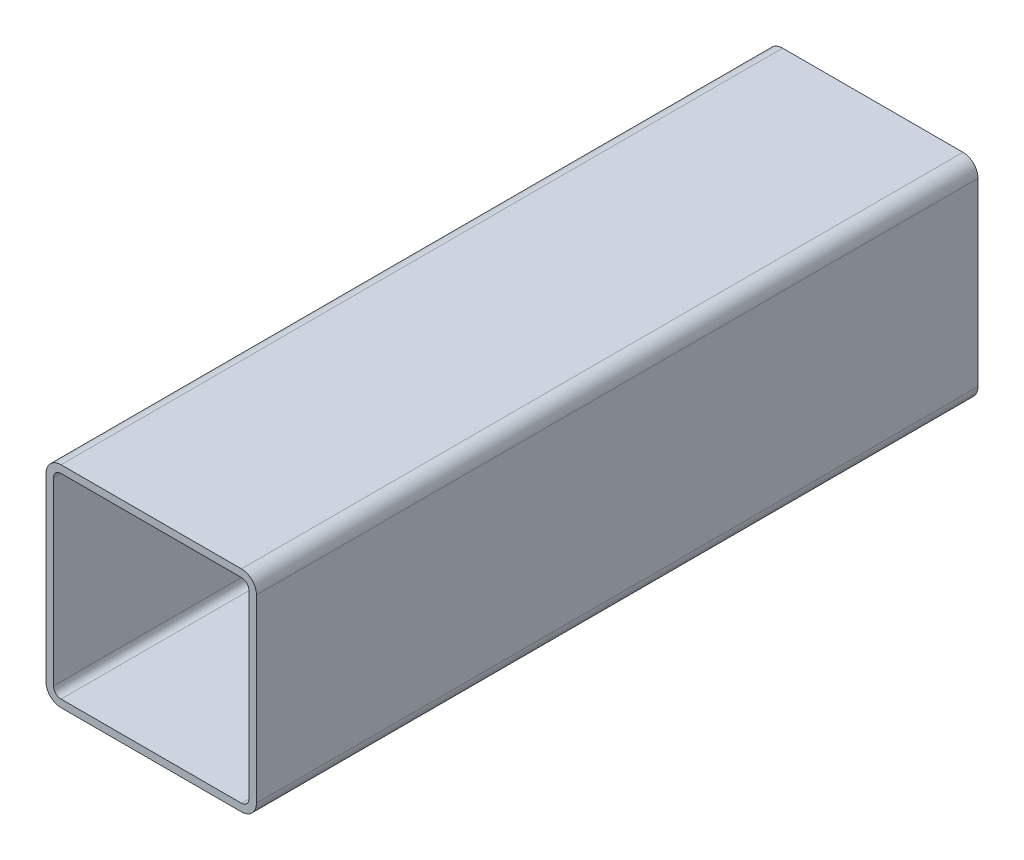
ISO-10303-21;
HEADER;
FILE_DESCRIPTION(('STEP AP214'),'2;1');
FILE_NAME('part.step','',(''),(''),'','','');
FILE_SCHEMA(('AUTOMOTIVE_DESIGN { 1 0 10303 214 1 1 1 1 }'));
ENDSEC;
DATA;
#1=APPLICATION_CONTEXT('core data for automotive mechanical design processes');
#2=APPLICATION_PROTOCOL_DEFINITION('international standard','automotive_design',2000,#1);
#3=PRODUCT_CONTEXT('',#1,'mechanical');
#4=PRODUCT('Part','Part','',(#3));
#5=PRODUCT_RELATED_PRODUCT_CATEGORY('part','',(#4));
#6=PRODUCT_DEFINITION_FORMATION('','',#4);
#7=PRODUCT_DEFINITION_CONTEXT('part definition',#1,'design');
#8=PRODUCT_DEFINITION('design','',#6,#7);
#9=PRODUCT_DEFINITION_SHAPE('','',#8);
#10=(LENGTH_UNIT() NAMED_UNIT(*) SI_UNIT(.MILLI.,.METRE.));
#11=(NAMED_UNIT(*) PLANE_ANGLE_UNIT() SI_UNIT($,.RADIAN.));
#12=(NAMED_UNIT(*) SI_UNIT($,.STERADIAN.) SOLID_ANGLE_UNIT());
#13=UNCERTAINTY_MEASURE_WITH_UNIT(LENGTH_MEASURE(1.E-05),#10,'distance_accuracy_value','');
#14=(GEOMETRIC_REPRESENTATION_CONTEXT(3) GLOBAL_UNCERTAINTY_ASSIGNED_CONTEXT((#13)) GLOBAL_UNIT_ASSIGNED_CONTEXT((#10,
#11,#12)) REPRESENTATION_CONTEXT('',''));
#15=CARTESIAN_POINT('',(0.,0.,0.));
#16=DIRECTION('',(0.,0.,1.));
#17=DIRECTION('',(1.,0.,0.));
#18=AXIS2_PLACEMENT_3D('',#15,#16,#17);
#19=CARTESIAN_POINT('',(8.43214692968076,83.3515103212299,304.8));
#20=DIRECTION('',(0.,0.,1.));
#21=DIRECTION('',(1.,0.,0.));
#22=AXIS2_PLACEMENT_3D('',#19,#20,#21);
#23=PLANE('',#22);
#24=CARTESIAN_POINT('',(8.43214692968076,83.3515103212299,304.8));
#25=DIRECTION('',(0.,0.,1.));
#26=DIRECTION('',(1.,0.,0.));
#27=AXIS2_PLACEMENT_3D('',#24,#25,#26);
#28=CIRCLE('',#27,6.35);
#29=CARTESIAN_POINT('',(8.43214692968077,89.7015103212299,304.8));
#30=VERTEX_POINT('',#29);
#31=CARTESIAN_POINT('',(2.08214692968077,83.3515103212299,304.8));
#32=VERTEX_POINT('',#31);
#33=EDGE_CURVE('E211',#30,#32,#28,.T.);
#34=ORIENTED_EDGE('',*,*,#33,.T.);
#35=DIRECTION('',(0.,-1.,0.));
#36=VECTOR('',#35,1.);
#37=CARTESIAN_POINT('',(2.08214692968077,7.15151032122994,304.8));
#38=LINE('',#37,#36);
#39=CARTESIAN_POINT('',(2.08214692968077,7.15151032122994,304.8));
#40=VERTEX_POINT('',#39);
#41=EDGE_CURVE('E214',#32,#40,#38,.T.);
#42=ORIENTED_EDGE('',*,*,#41,.T.);
#43=CARTESIAN_POINT('',(8.43214692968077,7.15151032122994,304.8));
#44=DIRECTION('',(0.,0.,1.));
#45=DIRECTION('',(1.,0.,0.));
#46=AXIS2_PLACEMENT_3D('',#43,#44,#45);
#47=CIRCLE('',#46,6.35);
#48=CARTESIAN_POINT('',(8.43214692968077,0.801510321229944,304.8));
#49=VERTEX_POINT('',#48);
#50=EDGE_CURVE('E217',#40,#49,#47,.T.);
#51=ORIENTED_EDGE('',*,*,#50,.T.);
#52=DIRECTION('',(1.,0.,0.));
#53=VECTOR('',#52,1.);
#54=CARTESIAN_POINT('',(84.6321469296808,0.801510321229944,304.8));
#55=LINE('',#54,#53);
#56=CARTESIAN_POINT('',(84.6321469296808,0.801510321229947,304.8));
#57=VERTEX_POINT('',#56);
#58=EDGE_CURVE('E219',#49,#57,#55,.T.);
#59=ORIENTED_EDGE('',*,*,#58,.T.);
#60=CARTESIAN_POINT('',(84.6321469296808,7.15151032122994,304.8));
#61=DIRECTION('',(0.,0.,1.));
#62=DIRECTION('',(1.,0.,0.));
#63=AXIS2_PLACEMENT_3D('',#60,#61,#62);
#64=CIRCLE('',#63,6.35);
#65=CARTESIAN_POINT('',(90.9821469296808,7.15151032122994,304.8));
#66=VERTEX_POINT('',#65);
#67=EDGE_CURVE('E221',#57,#66,#64,.T.);
#68=ORIENTED_EDGE('',*,*,#67,.T.);
#69=DIRECTION('',(0.,1.,0.));
#70=VECTOR('',#69,1.);
#71=CARTESIAN_POINT('',(90.9821469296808,83.3515103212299,304.8));
#72=LINE('',#71,#70);
#73=CARTESIAN_POINT('',(90.9821469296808,83.3515103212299,304.8));
#74=VERTEX_POINT('',#73);
#75=EDGE_CURVE('E223',#66,#74,#72,.T.);
#76=ORIENTED_EDGE('',*,*,#75,.T.);
#77=CARTESIAN_POINT('',(84.6321469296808,83.3515103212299,304.8));
#78=DIRECTION('',(0.,0.,1.));
#79=DIRECTION('',(1.,0.,0.));
#80=AXIS2_PLACEMENT_3D('',#77,#78,#79);
#81=CIRCLE('',#80,6.34999999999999);
#82=CARTESIAN_POINT('',(84.6321469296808,89.7015103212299,304.8));
#83=VERTEX_POINT('',#82);
#84=EDGE_CURVE('E225',#74,#83,#81,.T.);
#85=ORIENTED_EDGE('',*,*,#84,.T.);
#86=DIRECTION('',(-1.,0.,0.));
#87=VECTOR('',#86,1.);
#88=CARTESIAN_POINT('',(8.43214692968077,89.7015103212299,304.8));
#89=LINE('',#88,#87);
#90=EDGE_CURVE('E227',#83,#30,#89,.T.);
#91=ORIENTED_EDGE('',*,*,#90,.T.);
#92=EDGE_LOOP('',(#34,#42,#51,#59,#68,#76,#85,#91));
#93=FACE_BOUND('',#92,.T.);
#94=DIRECTION('',(0.,-1.,0.));
#95=VECTOR('',#94,1.);
#96=CARTESIAN_POINT('',(5.25714692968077,7.15151032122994,304.8));
#97=LINE('',#96,#95);
#98=CARTESIAN_POINT('',(5.25714692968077,83.3515103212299,304.8));
#99=VERTEX_POINT('',#98);
#100=CARTESIAN_POINT('',(5.25714692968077,7.15151032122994,304.8));
#101=VERTEX_POINT('',#100);
#102=EDGE_CURVE('E154',#99,#101,#97,.T.);
#103=ORIENTED_EDGE('',*,*,#102,.F.);
#104=CARTESIAN_POINT('',(8.43214692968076,83.3515103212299,304.8));
#105=DIRECTION('',(0.,0.,1.));
#106=DIRECTION('',(1.,0.,0.));
#107=AXIS2_PLACEMENT_3D('',#104,#105,#106);
#108=CIRCLE('',#107,3.175);
#109=CARTESIAN_POINT('',(8.43214692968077,86.5265103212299,304.8));
#110=VERTEX_POINT('',#109);
#111=EDGE_CURVE('E146',#110,#99,#108,.T.);
#112=ORIENTED_EDGE('',*,*,#111,.F.);
#113=DIRECTION('',(-1.,0.,0.));
#114=VECTOR('',#113,1.);
#115=CARTESIAN_POINT('',(8.43214692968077,86.5265103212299,304.8));
#116=LINE('',#115,#114);
#117=CARTESIAN_POINT('',(84.6321469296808,86.5265103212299,304.8));
#118=VERTEX_POINT('',#117);
#119=EDGE_CURVE('E179',#118,#110,#116,.T.);
#120=ORIENTED_EDGE('',*,*,#119,.F.);
#121=CARTESIAN_POINT('',(84.6321469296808,83.3515103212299,304.8));
#122=DIRECTION('',(0.,0.,1.));
#123=DIRECTION('',(1.,0.,0.));
#124=AXIS2_PLACEMENT_3D('',#121,#122,#123);
#125=CIRCLE('',#124,3.175);
#126=CARTESIAN_POINT('',(87.8071469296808,83.3515103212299,304.8));
#127=VERTEX_POINT('',#126);
#128=EDGE_CURVE('E177',#127,#118,#125,.T.);
#129=ORIENTED_EDGE('',*,*,#128,.F.);
#130=DIRECTION('',(0.,1.,0.));
#131=VECTOR('',#130,1.);
#132=CARTESIAN_POINT('',(87.8071469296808,83.3515103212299,304.8));
#133=LINE('',#132,#131);
#134=CARTESIAN_POINT('',(87.8071469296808,7.15151032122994,304.8));
#135=VERTEX_POINT('',#134);
#136=EDGE_CURVE('E175',#135,#127,#133,.T.);
#137=ORIENTED_EDGE('',*,*,#136,.F.);
#138=CARTESIAN_POINT('',(84.6321469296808,7.15151032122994,304.8));
#139=DIRECTION('',(0.,0.,1.));
#140=DIRECTION('',(1.,0.,0.));
#141=AXIS2_PLACEMENT_3D('',#138,#139,#140);
#142=CIRCLE('',#141,3.175);
#143=CARTESIAN_POINT('',(84.6321469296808,3.97651032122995,304.8));
#144=VERTEX_POINT('',#143);
#145=EDGE_CURVE('E173',#144,#135,#142,.T.);
#146=ORIENTED_EDGE('',*,*,#145,.F.);
#147=DIRECTION('',(1.,0.,0.));
#148=VECTOR('',#147,1.);
#149=CARTESIAN_POINT('',(84.6321469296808,3.97651032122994,304.8));
#150=LINE('',#149,#148);
#151=CARTESIAN_POINT('',(8.43214692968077,3.97651032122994,304.8));
#152=VERTEX_POINT('',#151);
#153=EDGE_CURVE('E169',#152,#144,#150,.T.);
#154=ORIENTED_EDGE('',*,*,#153,.F.);
#155=CARTESIAN_POINT('',(8.43214692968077,7.15151032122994,304.8));
#156=DIRECTION('',(0.,0.,1.));
#157=DIRECTION('',(1.,0.,0.));
#158=AXIS2_PLACEMENT_3D('',#155,#156,#157);
#159=CIRCLE('',#158,3.175);
#160=EDGE_CURVE('E167',#101,#152,#159,.T.);
#161=ORIENTED_EDGE('',*,*,#160,.F.);
#162=EDGE_LOOP('',(#103,#112,#120,#129,#137,#146,#154,#161));
#163=FACE_BOUND('',#162,.T.);
#164=ADVANCED_FACE('F33',(#93,#163),#23,.T.);
#165=CARTESIAN_POINT('',(8.43214692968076,83.3515103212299,0.));
#166=DIRECTION('',(0.,0.,1.));
#167=DIRECTION('',(1.,0.,0.));
#168=AXIS2_PLACEMENT_3D('',#165,#166,#167);
#169=PLANE('',#168);
#170=CARTESIAN_POINT('',(8.43214692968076,83.3515103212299,0.));
#171=DIRECTION('',(0.,0.,1.));
#172=DIRECTION('',(1.,0.,0.));
#173=AXIS2_PLACEMENT_3D('',#170,#171,#172);
#174=CIRCLE('',#173,6.35);
#175=CARTESIAN_POINT('',(8.43214692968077,89.7015103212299,0.));
#176=VERTEX_POINT('',#175);
#177=CARTESIAN_POINT('',(2.08214692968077,83.3515103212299,0.));
#178=VERTEX_POINT('',#177);
#179=EDGE_CURVE('E162',#176,#178,#174,.T.);
#180=ORIENTED_EDGE('',*,*,#179,.F.);
#181=DIRECTION('',(-1.,0.,0.));
#182=VECTOR('',#181,1.);
#183=CARTESIAN_POINT('',(8.43214692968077,89.7015103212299,0.));
#184=LINE('',#183,#182);
#185=CARTESIAN_POINT('',(84.6321469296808,89.7015103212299,0.));
#186=VERTEX_POINT('',#185);
#187=EDGE_CURVE('E215',#186,#176,#184,.T.);
#188=ORIENTED_EDGE('',*,*,#187,.F.);
#189=CARTESIAN_POINT('',(84.6321469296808,83.3515103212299,0.));
#190=DIRECTION('',(0.,0.,1.));
#191=DIRECTION('',(1.,0.,0.));
#192=AXIS2_PLACEMENT_3D('',#189,#190,#191);
#193=CIRCLE('',#192,6.34999999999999);
#194=CARTESIAN_POINT('',(90.9821469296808,83.3515103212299,0.));
#195=VERTEX_POINT('',#194);
#196=EDGE_CURVE('E242',#195,#186,#193,.T.);
#197=ORIENTED_EDGE('',*,*,#196,.F.);
#198=DIRECTION('',(0.,1.,0.));
#199=VECTOR('',#198,1.);
#200=CARTESIAN_POINT('',(90.9821469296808,83.3515103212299,0.));
#201=LINE('',#200,#199);
#202=CARTESIAN_POINT('',(90.9821469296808,7.15151032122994,0.));
#203=VERTEX_POINT('',#202);
#204=EDGE_CURVE('E240',#203,#195,#201,.T.);
#205=ORIENTED_EDGE('',*,*,#204,.F.);
#206=CARTESIAN_POINT('',(84.6321469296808,7.15151032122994,0.));
#207=DIRECTION('',(0.,0.,1.));
#208=DIRECTION('',(1.,0.,0.));
#209=AXIS2_PLACEMENT_3D('',#206,#207,#208);
#210=CIRCLE('',#209,6.35);
#211=CARTESIAN_POINT('',(84.6321469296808,0.801510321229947,0.));
#212=VERTEX_POINT('',#211);
#213=EDGE_CURVE('E238',#212,#203,#210,.T.);
#214=ORIENTED_EDGE('',*,*,#213,.F.);
#215=DIRECTION('',(1.,0.,0.));
#216=VECTOR('',#215,1.);
#217=CARTESIAN_POINT('',(84.6321469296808,0.801510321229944,0.));
#218=LINE('',#217,#216);
#219=CARTESIAN_POINT('',(8.43214692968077,0.801510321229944,0.));
#220=VERTEX_POINT('',#219);
#221=EDGE_CURVE('E236',#220,#212,#218,.T.);
#222=ORIENTED_EDGE('',*,*,#221,.F.);
#223=CARTESIAN_POINT('',(8.43214692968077,7.15151032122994,0.));
#224=DIRECTION('',(0.,0.,1.));
#225=DIRECTION('',(1.,0.,0.));
#226=AXIS2_PLACEMENT_3D('',#223,#224,#225);
#227=CIRCLE('',#226,6.35);
#228=CARTESIAN_POINT('',(2.08214692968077,7.15151032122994,0.));
#229=VERTEX_POINT('',#228);
#230=EDGE_CURVE('E234',#229,#220,#227,.T.);
#231=ORIENTED_EDGE('',*,*,#230,.F.);
#232=DIRECTION('',(0.,-1.,0.));
#233=VECTOR('',#232,1.);
#234=CARTESIAN_POINT('',(2.08214692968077,7.15151032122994,0.));
#235=LINE('',#234,#233);
#236=EDGE_CURVE('E232',#178,#229,#235,.T.);
#237=ORIENTED_EDGE('',*,*,#236,.F.);
#238=EDGE_LOOP('',(#180,#188,#197,#205,#214,#222,#231,#237));
#239=FACE_BOUND('',#238,.T.);
#240=CARTESIAN_POINT('',(8.43214692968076,83.3515103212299,0.));
#241=DIRECTION('',(0.,0.,1.));
#242=DIRECTION('',(1.,0.,0.));
#243=AXIS2_PLACEMENT_3D('',#240,#241,#242);
#244=CIRCLE('',#243,3.175);
#245=CARTESIAN_POINT('',(8.43214692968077,86.5265103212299,0.));
#246=VERTEX_POINT('',#245);
#247=CARTESIAN_POINT('',(5.25714692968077,83.3515103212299,0.));
#248=VERTEX_POINT('',#247);
#249=EDGE_CURVE('E56',#246,#248,#244,.T.);
#250=ORIENTED_EDGE('',*,*,#249,.T.);
#251=DIRECTION('',(0.,-1.,0.));
#252=VECTOR('',#251,1.);
#253=CARTESIAN_POINT('',(5.25714692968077,7.15151032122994,0.));
#254=LINE('',#253,#252);
#255=CARTESIAN_POINT('',(5.25714692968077,7.15151032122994,0.));
#256=VERTEX_POINT('',#255);
#257=EDGE_CURVE('E161',#248,#256,#254,.T.);
#258=ORIENTED_EDGE('',*,*,#257,.T.);
#259=CARTESIAN_POINT('',(8.43214692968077,7.15151032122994,0.));
#260=DIRECTION('',(0.,0.,1.));
#261=DIRECTION('',(1.,0.,0.));
#262=AXIS2_PLACEMENT_3D('',#259,#260,#261);
#263=CIRCLE('',#262,3.175);
#264=CARTESIAN_POINT('',(8.43214692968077,3.97651032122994,0.));
#265=VERTEX_POINT('',#264);
#266=EDGE_CURVE('E183',#256,#265,#263,.T.);
#267=ORIENTED_EDGE('',*,*,#266,.T.);
#268=DIRECTION('',(1.,0.,0.));
#269=VECTOR('',#268,1.);
#270=CARTESIAN_POINT('',(84.6321469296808,3.97651032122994,0.));
#271=LINE('',#270,#269);
#272=CARTESIAN_POINT('',(84.6321469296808,3.97651032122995,0.));
#273=VERTEX_POINT('',#272);
#274=EDGE_CURVE('E186',#265,#273,#271,.T.);
#275=ORIENTED_EDGE('',*,*,#274,.T.);
#276=CARTESIAN_POINT('',(84.6321469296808,7.15151032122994,0.));
#277=DIRECTION('',(0.,0.,1.));
#278=DIRECTION('',(1.,0.,0.));
#279=AXIS2_PLACEMENT_3D('',#276,#277,#278);
#280=CIRCLE('',#279,3.175);
#281=CARTESIAN_POINT('',(87.8071469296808,7.15151032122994,0.));
#282=VERTEX_POINT('',#281);
#283=EDGE_CURVE('E189',#273,#282,#280,.T.);
#284=ORIENTED_EDGE('',*,*,#283,.T.);
#285=DIRECTION('',(0.,1.,0.));
#286=VECTOR('',#285,1.);
#287=CARTESIAN_POINT('',(87.8071469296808,83.3515103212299,0.));
#288=LINE('',#287,#286);
#289=CARTESIAN_POINT('',(87.8071469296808,83.3515103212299,0.));
#290=VERTEX_POINT('',#289);
#291=EDGE_CURVE('E192',#282,#290,#288,.T.);
#292=ORIENTED_EDGE('',*,*,#291,.T.);
#293=CARTESIAN_POINT('',(84.6321469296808,83.3515103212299,0.));
#294=DIRECTION('',(0.,0.,1.));
#295=DIRECTION('',(1.,0.,0.));
#296=AXIS2_PLACEMENT_3D('',#293,#294,#295);
#297=CIRCLE('',#296,3.175);
#298=CARTESIAN_POINT('',(84.6321469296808,86.5265103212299,0.));
#299=VERTEX_POINT('',#298);
#300=EDGE_CURVE('E195',#290,#299,#297,.T.);
#301=ORIENTED_EDGE('',*,*,#300,.T.);
#302=DIRECTION('',(-1.,0.,0.));
#303=VECTOR('',#302,1.);
#304=CARTESIAN_POINT('',(8.43214692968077,86.5265103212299,0.));
#305=LINE('',#304,#303);
#306=EDGE_CURVE('E155',#299,#246,#305,.T.);
#307=ORIENTED_EDGE('',*,*,#306,.T.);
#308=EDGE_LOOP('',(#250,#258,#267,#275,#284,#292,#301,#307));
#309=FACE_BOUND('',#308,.T.);
#310=ADVANCED_FACE('F272',(#239,#309),#169,.F.);
#311=CARTESIAN_POINT('',(8.43214692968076,83.3515103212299,304.8));
#312=DIRECTION('',(0.,0.,-1.));
#313=DIRECTION('',(-1.,0.,0.));
#314=AXIS2_PLACEMENT_3D('',#311,#312,#313);
#315=CYLINDRICAL_SURFACE('',#314,6.35);
#316=ORIENTED_EDGE('',*,*,#179,.T.);
#317=DIRECTION('',(0.,0.,-1.));
#318=VECTOR('',#317,1.);
#319=CARTESIAN_POINT('',(2.08214692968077,83.3515103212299,304.8));
#320=LINE('',#319,#318);
#321=EDGE_CURVE('E11',#32,#178,#320,.T.);
#322=ORIENTED_EDGE('',*,*,#321,.F.);
#323=ORIENTED_EDGE('',*,*,#33,.F.);
#324=DIRECTION('',(0.,0.,-1.));
#325=VECTOR('',#324,1.);
#326=CARTESIAN_POINT('',(8.43214692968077,89.7015103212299,304.8));
#327=LINE('',#326,#325);
#328=EDGE_CURVE('E229',#30,#176,#327,.T.);
#329=ORIENTED_EDGE('',*,*,#328,.T.);
#330=EDGE_LOOP('',(#316,#322,#323,#329));
#331=FACE_BOUND('',#330,.T.);
#332=ADVANCED_FACE('F35',(#331),#315,.T.);
#333=CARTESIAN_POINT('',(2.08214692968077,7.15151032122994,304.8));
#334=DIRECTION('',(1.,0.,0.));
#335=DIRECTION('',(0.,0.,-1.));
#336=AXIS2_PLACEMENT_3D('',#333,#334,#335);
#337=PLANE('',#336);
#338=ORIENTED_EDGE('',*,*,#236,.T.);
#339=DIRECTION('',(0.,0.,-1.));
#340=VECTOR('',#339,1.);
#341=CARTESIAN_POINT('',(2.08214692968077,7.15151032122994,304.8));
#342=LINE('',#341,#340);
#343=EDGE_CURVE('E41',#40,#229,#342,.T.);
#344=ORIENTED_EDGE('',*,*,#343,.F.);
#345=ORIENTED_EDGE('',*,*,#41,.F.);
#346=ORIENTED_EDGE('',*,*,#321,.T.);
#347=EDGE_LOOP('',(#338,#344,#345,#346));
#348=FACE_BOUND('',#347,.T.);
#349=ADVANCED_FACE('F289',(#348),#337,.F.);
#350=CARTESIAN_POINT('',(8.43214692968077,7.15151032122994,304.8));
#351=DIRECTION('',(0.,0.,-1.));
#352=DIRECTION('',(-1.,0.,0.));
#353=AXIS2_PLACEMENT_3D('',#350,#351,#352);
#354=CYLINDRICAL_SURFACE('',#353,6.35);
#355=ORIENTED_EDGE('',*,*,#230,.T.);
#356=DIRECTION('',(0.,0.,-1.));
#357=VECTOR('',#356,1.);
#358=CARTESIAN_POINT('',(8.43214692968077,0.801510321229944,304.8));
#359=LINE('',#358,#357);
#360=EDGE_CURVE('E259',#49,#220,#359,.T.);
#361=ORIENTED_EDGE('',*,*,#360,.F.);
#362=ORIENTED_EDGE('',*,*,#50,.F.);
#363=ORIENTED_EDGE('',*,*,#343,.T.);
#364=EDGE_LOOP('',(#355,#361,#362,#363));
#365=FACE_BOUND('',#364,.T.);
#366=ADVANCED_FACE('F266',(#365),#354,.T.);
#367=CARTESIAN_POINT('',(84.6321469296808,0.801510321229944,304.8));
#368=DIRECTION('',(0.,1.,0.));
#369=DIRECTION('',(0.,0.,1.));
#370=AXIS2_PLACEMENT_3D('',#367,#368,#369);
#371=PLANE('',#370);
#372=ORIENTED_EDGE('',*,*,#221,.T.);
#373=DIRECTION('',(0.,0.,-1.));
#374=VECTOR('',#373,1.);
#375=CARTESIAN_POINT('',(84.6321469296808,0.801510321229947,304.8));
#376=LINE('',#375,#374);
#377=EDGE_CURVE('E256',#57,#212,#376,.T.);
#378=ORIENTED_EDGE('',*,*,#377,.F.);
#379=ORIENTED_EDGE('',*,*,#58,.F.);
#380=ORIENTED_EDGE('',*,*,#360,.T.);
#381=EDGE_LOOP('',(#372,#378,#379,#380));
#382=FACE_BOUND('',#381,.T.);
#383=ADVANCED_FACE('F278',(#382),#371,.F.);
#384=CARTESIAN_POINT('',(84.6321469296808,7.15151032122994,304.8));
#385=DIRECTION('',(0.,0.,-1.));
#386=DIRECTION('',(-1.,0.,0.));
#387=AXIS2_PLACEMENT_3D('',#384,#385,#386);
#388=CYLINDRICAL_SURFACE('',#387,6.35);
#389=ORIENTED_EDGE('',*,*,#213,.T.);
#390=DIRECTION('',(0.,0.,-1.));
#391=VECTOR('',#390,1.);
#392=CARTESIAN_POINT('',(90.9821469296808,7.15151032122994,304.8));
#393=LINE('',#392,#391);
#394=EDGE_CURVE('E253',#66,#203,#393,.T.);
#395=ORIENTED_EDGE('',*,*,#394,.F.);
#396=ORIENTED_EDGE('',*,*,#67,.F.);
#397=ORIENTED_EDGE('',*,*,#377,.T.);
#398=EDGE_LOOP('',(#389,#395,#396,#397));
#399=FACE_BOUND('',#398,.T.);
#400=ADVANCED_FACE('F282',(#399),#388,.T.);
#401=CARTESIAN_POINT('',(90.9821469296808,83.3515103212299,304.8));
#402=DIRECTION('',(-1.,0.,0.));
#403=DIRECTION('',(0.,0.,1.));
#404=AXIS2_PLACEMENT_3D('',#401,#402,#403);
#405=PLANE('',#404);
#406=ORIENTED_EDGE('',*,*,#204,.T.);
#407=DIRECTION('',(0.,0.,-1.));
#408=VECTOR('',#407,1.);
#409=CARTESIAN_POINT('',(90.9821469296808,83.3515103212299,304.8));
#410=LINE('',#409,#408);
#411=EDGE_CURVE('E250',#74,#195,#410,.T.);
#412=ORIENTED_EDGE('',*,*,#411,.F.);
#413=ORIENTED_EDGE('',*,*,#75,.F.);
#414=ORIENTED_EDGE('',*,*,#394,.T.);
#415=EDGE_LOOP('',(#406,#412,#413,#414));
#416=FACE_BOUND('',#415,.T.);
#417=ADVANCED_FACE('F302',(#416),#405,.F.);
#418=CARTESIAN_POINT('',(84.6321469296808,83.3515103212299,304.8));
#419=DIRECTION('',(0.,0.,-1.));
#420=DIRECTION('',(-1.,0.,0.));
#421=AXIS2_PLACEMENT_3D('',#418,#419,#420);
#422=CYLINDRICAL_SURFACE('',#421,6.34999999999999);
#423=ORIENTED_EDGE('',*,*,#196,.T.);
#424=DIRECTION('',(0.,0.,-1.));
#425=VECTOR('',#424,1.);
#426=CARTESIAN_POINT('',(84.6321469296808,89.7015103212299,304.8));
#427=LINE('',#426,#425);
#428=EDGE_CURVE('E247',#83,#186,#427,.T.);
#429=ORIENTED_EDGE('',*,*,#428,.F.);
#430=ORIENTED_EDGE('',*,*,#84,.F.);
#431=ORIENTED_EDGE('',*,*,#411,.T.);
#432=EDGE_LOOP('',(#423,#429,#430,#431));
#433=FACE_BOUND('',#432,.T.);
#434=ADVANCED_FACE('F300',(#433),#422,.T.);
#435=CARTESIAN_POINT('',(8.43214692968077,89.7015103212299,304.8));
#436=DIRECTION('',(0.,-1.,0.));
#437=DIRECTION('',(0.,0.,-1.));
#438=AXIS2_PLACEMENT_3D('',#435,#436,#437);
#439=PLANE('',#438);
#440=ORIENTED_EDGE('',*,*,#187,.T.);
#441=ORIENTED_EDGE('',*,*,#328,.F.);
#442=ORIENTED_EDGE('',*,*,#90,.F.);
#443=ORIENTED_EDGE('',*,*,#428,.T.);
#444=EDGE_LOOP('',(#440,#441,#442,#443));
#445=FACE_BOUND('',#444,.T.);
#446=ADVANCED_FACE('F295',(#445),#439,.F.);
#447=CARTESIAN_POINT('',(8.43214692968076,83.3515103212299,304.8));
#448=DIRECTION('',(0.,0.,-1.));
#449=DIRECTION('',(-1.,0.,0.));
#450=AXIS2_PLACEMENT_3D('',#447,#448,#449);
#451=CYLINDRICAL_SURFACE('',#450,3.175);
#452=ORIENTED_EDGE('',*,*,#249,.F.);
#453=DIRECTION('',(0.,0.,-1.));
#454=VECTOR('',#453,1.);
#455=CARTESIAN_POINT('',(8.43214692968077,86.5265103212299,304.8));
#456=LINE('',#455,#454);
#457=EDGE_CURVE('E150',#110,#246,#456,.T.);
#458=ORIENTED_EDGE('',*,*,#457,.F.);
#459=ORIENTED_EDGE('',*,*,#111,.T.);
#460=DIRECTION('',(0.,0.,-1.));
#461=VECTOR('',#460,1.);
#462=CARTESIAN_POINT('',(5.25714692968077,83.3515103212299,304.8));
#463=LINE('',#462,#461);
#464=EDGE_CURVE('E149',#99,#248,#463,.T.);
#465=ORIENTED_EDGE('',*,*,#464,.T.);
#466=EDGE_LOOP('',(#452,#458,#459,#465));
#467=FACE_BOUND('',#466,.T.);
#468=ADVANCED_FACE('F148',(#467),#451,.F.);
#469=CARTESIAN_POINT('',(5.25714692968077,7.15151032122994,304.8));
#470=DIRECTION('',(1.,0.,0.));
#471=DIRECTION('',(0.,0.,-1.));
#472=AXIS2_PLACEMENT_3D('',#469,#470,#471);
#473=PLANE('',#472);
#474=ORIENTED_EDGE('',*,*,#257,.F.);
#475=ORIENTED_EDGE('',*,*,#464,.F.);
#476=ORIENTED_EDGE('',*,*,#102,.T.);
#477=DIRECTION('',(0.,0.,-1.));
#478=VECTOR('',#477,1.);
#479=CARTESIAN_POINT('',(5.25714692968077,7.15151032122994,304.8));
#480=LINE('',#479,#478);
#481=EDGE_CURVE('E163',#101,#256,#480,.T.);
#482=ORIENTED_EDGE('',*,*,#481,.T.);
#483=EDGE_LOOP('',(#474,#475,#476,#482));
#484=FACE_BOUND('',#483,.T.);
#485=ADVANCED_FACE('F158',(#484),#473,.T.);
#486=CARTESIAN_POINT('',(8.43214692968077,7.15151032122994,304.8));
#487=DIRECTION('',(0.,0.,-1.));
#488=DIRECTION('',(-1.,0.,0.));
#489=AXIS2_PLACEMENT_3D('',#486,#487,#488);
#490=CYLINDRICAL_SURFACE('',#489,3.175);
#491=ORIENTED_EDGE('',*,*,#266,.F.);
#492=ORIENTED_EDGE('',*,*,#481,.F.);
#493=ORIENTED_EDGE('',*,*,#160,.T.);
#494=DIRECTION('',(0.,0.,-1.));
#495=VECTOR('',#494,1.);
#496=CARTESIAN_POINT('',(8.43214692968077,3.97651032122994,304.8));
#497=LINE('',#496,#495);
#498=EDGE_CURVE('E208',#152,#265,#497,.T.);
#499=ORIENTED_EDGE('',*,*,#498,.T.);
#500=EDGE_LOOP('',(#491,#492,#493,#499));
#501=FACE_BOUND('',#500,.T.);
#502=ADVANCED_FACE('F327',(#501),#490,.F.);
#503=CARTESIAN_POINT('',(84.6321469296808,3.97651032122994,304.8));
#504=DIRECTION('',(0.,1.,0.));
#505=DIRECTION('',(0.,0.,1.));
#506=AXIS2_PLACEMENT_3D('',#503,#504,#505);
#507=PLANE('',#506);
#508=ORIENTED_EDGE('',*,*,#274,.F.);
#509=ORIENTED_EDGE('',*,*,#498,.F.);
#510=ORIENTED_EDGE('',*,*,#153,.T.);
#511=DIRECTION('',(0.,0.,-1.));
#512=VECTOR('',#511,1.);
#513=CARTESIAN_POINT('',(84.6321469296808,3.97651032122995,304.8));
#514=LINE('',#513,#512);
#515=EDGE_CURVE('E206',#144,#273,#514,.T.);
#516=ORIENTED_EDGE('',*,*,#515,.T.);
#517=EDGE_LOOP('',(#508,#509,#510,#516));
#518=FACE_BOUND('',#517,.T.);
#519=ADVANCED_FACE('F331',(#518),#507,.T.);
#520=CARTESIAN_POINT('',(84.6321469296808,7.15151032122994,304.8));
#521=DIRECTION('',(0.,0.,-1.));
#522=DIRECTION('',(-1.,0.,0.));
#523=AXIS2_PLACEMENT_3D('',#520,#521,#522);
#524=CYLINDRICAL_SURFACE('',#523,3.175);
#525=ORIENTED_EDGE('',*,*,#283,.F.);
#526=ORIENTED_EDGE('',*,*,#515,.F.);
#527=ORIENTED_EDGE('',*,*,#145,.T.);
#528=DIRECTION('',(0.,0.,-1.));
#529=VECTOR('',#528,1.);
#530=CARTESIAN_POINT('',(87.8071469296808,7.15151032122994,304.8));
#531=LINE('',#530,#529);
#532=EDGE_CURVE('E204',#135,#282,#531,.T.);
#533=ORIENTED_EDGE('',*,*,#532,.T.);
#534=EDGE_LOOP('',(#525,#526,#527,#533));
#535=FACE_BOUND('',#534,.T.);
#536=ADVANCED_FACE('F337',(#535),#524,.F.);
#537=CARTESIAN_POINT('',(87.8071469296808,83.3515103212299,304.8));
#538=DIRECTION('',(-1.,0.,0.));
#539=DIRECTION('',(0.,0.,1.));
#540=AXIS2_PLACEMENT_3D('',#537,#538,#539);
#541=PLANE('',#540);
#542=ORIENTED_EDGE('',*,*,#291,.F.);
#543=ORIENTED_EDGE('',*,*,#532,.F.);
#544=ORIENTED_EDGE('',*,*,#136,.T.);
#545=DIRECTION('',(0.,0.,-1.));
#546=VECTOR('',#545,1.);
#547=CARTESIAN_POINT('',(87.8071469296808,83.3515103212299,304.8));
#548=LINE('',#547,#546);
#549=EDGE_CURVE('E202',#127,#290,#548,.T.);
#550=ORIENTED_EDGE('',*,*,#549,.T.);
#551=EDGE_LOOP('',(#542,#543,#544,#550));
#552=FACE_BOUND('',#551,.T.);
#553=ADVANCED_FACE('F341',(#552),#541,.T.);
#554=CARTESIAN_POINT('',(84.6321469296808,83.3515103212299,304.8));
#555=DIRECTION('',(0.,0.,-1.));
#556=DIRECTION('',(-1.,0.,0.));
#557=AXIS2_PLACEMENT_3D('',#554,#555,#556);
#558=CYLINDRICAL_SURFACE('',#557,3.175);
#559=ORIENTED_EDGE('',*,*,#300,.F.);
#560=ORIENTED_EDGE('',*,*,#549,.F.);
#561=ORIENTED_EDGE('',*,*,#128,.T.);
#562=DIRECTION('',(0.,0.,-1.));
#563=VECTOR('',#562,1.);
#564=CARTESIAN_POINT('',(84.6321469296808,86.5265103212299,304.8));
#565=LINE('',#564,#563);
#566=EDGE_CURVE('E48',#118,#299,#565,.T.);
#567=ORIENTED_EDGE('',*,*,#566,.T.);
#568=EDGE_LOOP('',(#559,#560,#561,#567));
#569=FACE_BOUND('',#568,.T.);
#570=ADVANCED_FACE('F345',(#569),#558,.F.);
#571=CARTESIAN_POINT('',(8.43214692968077,86.5265103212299,304.8));
#572=DIRECTION('',(0.,-1.,0.));
#573=DIRECTION('',(0.,0.,-1.));
#574=AXIS2_PLACEMENT_3D('',#571,#572,#573);
#575=PLANE('',#574);
#576=ORIENTED_EDGE('',*,*,#306,.F.);
#577=ORIENTED_EDGE('',*,*,#566,.F.);
#578=ORIENTED_EDGE('',*,*,#119,.T.);
#579=ORIENTED_EDGE('',*,*,#457,.T.);
#580=EDGE_LOOP('',(#576,#577,#578,#579));
#581=FACE_BOUND('',#580,.T.);
#582=ADVANCED_FACE('F349',(#581),#575,.T.);
#583=CLOSED_SHELL('',(#164,#310,#332,#349,#366,#383,#400,#417,#434,#446,#468,#485,#502,#519,
#536,#553,#570,#582));
#584=MANIFOLD_SOLID_BREP('B2',#583);
#585=ADVANCED_BREP_SHAPE_REPRESENTATION('',(#18,#584),#14);
#586=SHAPE_DEFINITION_REPRESENTATION(#9,#585);
ENDSEC;
END-ISO-10303-21;
